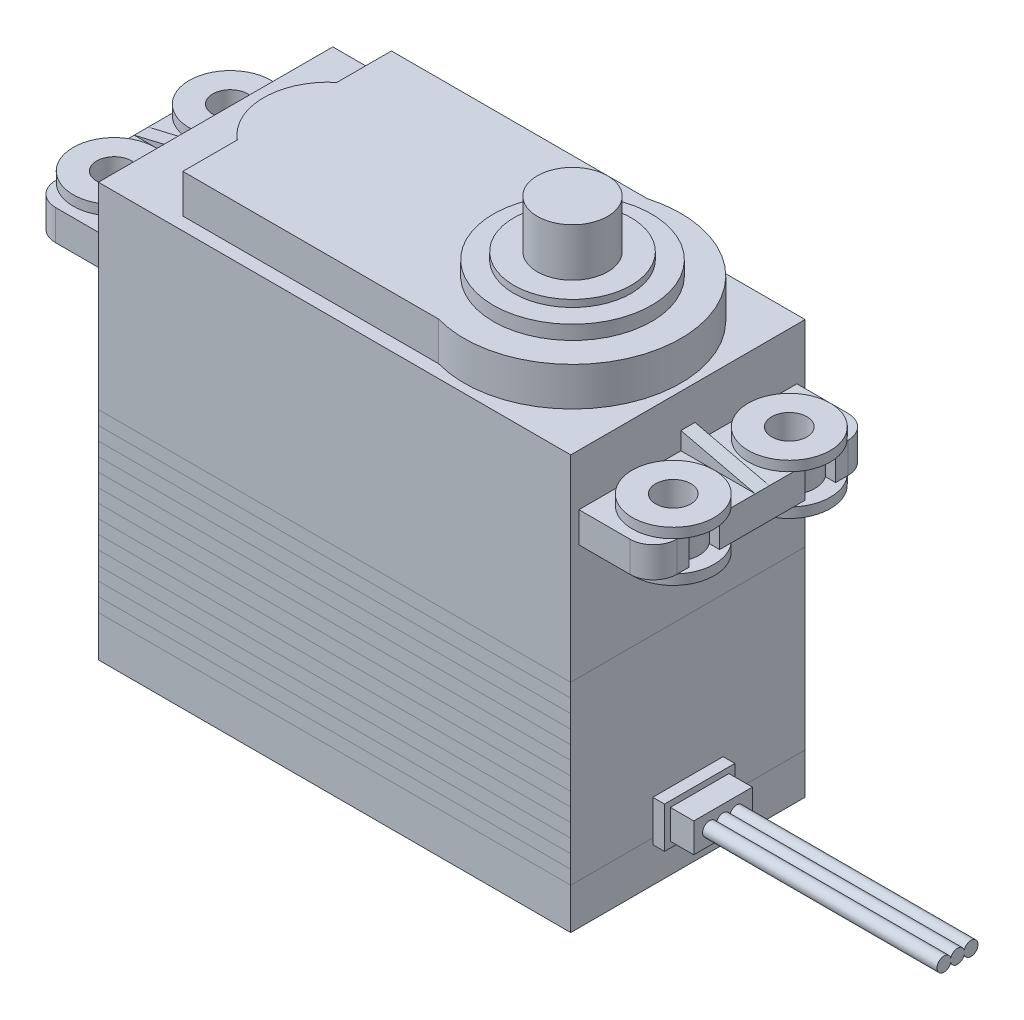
from build123d import *

# Parameters (mm, degrees)
ESQUISSE1_W                              = 40.3
ESQUISSE1_H                              = 20
BOSS_EXTRU_1_DEPTH                       = 35.3
BOSS_EXTRU_2_DEPTH                       = 2.6
BOSS_EXTRU_3_DEPTH                       = 0.6
CONG_1_R                                 = 2
BOSS_EXTRU_4_DEPTH                       = 3.3
ESQUISSE5_R                              = 6.75
BOSS_EXTRU_5_DEPTH                       = 1.2
ESQUISSE6_R                              = 5
BOSS_EXTRU_6_DEPTH                       = 0.6
ESQUISSE7_R                              = 3
BOSS_EXTRU_7_DEPTH                       = 4.1
ESQUISSE10_W                             = 2.2
ESQUISSE10_H                             = 30.9
DIAM_TRE_DU_PER_AGE_4_4_4_4_1_AT_2_COUNT = 2
DIAM_TRE_DU_PER_AGE_4_4_4_4_1_AT_2_PITCH = 9.9
DIAM_TRE_DU_PER_AGE_4_4_4_4_1_AT_3_COUNT = 2
DIAM_TRE_DU_PER_AGE_4_4_4_4_1_AT_3_PITCH = 48.71652697
DIAM_TRE_DU_PER_AGE_4_4_4_4_1_AT_4_COUNT = 2
DIAM_TRE_DU_PER_AGE_4_4_4_4_1_AT_4_PITCH = 47.7
R_P_TITION_LIN_AIRE1_COUNT               = 2
R_P_TITION_LIN_AIRE1_PITCH               = 47.7
R_P_TITION_LIN_AIRE1_COUNT_DIR2          = 2
R_P_TITION_LIN_AIRE1_PITCH_DIR2          = 9.9
ESQUISSE13_W                             = 6
ESQUISSE13_H                             = 3.5
BOSS_EXTRU_8_DEPTH                       = 1
ESQUISSE14_W                             = 5
ESQUISSE14_H                             = 2.5
BOSS_EXTRU_9_DEPTH                       = 2
BOSS_EXTRU_10_DEPTH                      = 20


with BuildPart() as part:
    # Esquisse1 → Boss.-Extru.1 (new body)
    with BuildSketch(Plane(origin=(0, 0, 0), x_dir=(1, 0, 0), z_dir=(0, 1, 0))):
        Rectangle(ESQUISSE1_W, ESQUISSE1_H)
    extrude(amount=BOSS_EXTRU_1_DEPTH)

    # Esquisse2 → Boss.-Extru.2 (add)
    with BuildSketch(Plane(origin=(0, 28.3, 0), x_dir=(-1, 0, 0), z_dir=(0, -1, 0))):
        with BuildLine():
            Line((-26.5, 9.3), (-20.15, 9.3))
            Line((-20.15, 9.3), (-20.15, -9.3))
            Line((-20.15, -9.3), (-26.5, -9.3))
            Line((-26.5, -9.3), (-26.5, -6.25))
            Line((-26.5, -6.25), (-25.562454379, -6.25))
            ThreePointArc((-25.562454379, -6.25), (-21.7, -4.95), (-25.562454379, -3.65))
            Line((-25.562454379, -3.65), (-26.5, -3.65))
            Line((-26.5, -3.65), (-26.5, 3.65))
            Line((-26.5, 3.65), (-25.562454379, 3.65))
            ThreePointArc((-25.562454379, 3.65), (-21.7, 4.95), (-25.562454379, 6.25))
            Line((-25.562454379, 6.25), (-26.5, 6.25))
            Line((-26.5, 6.25), (-26.5, 9.3))
        make_face()
        with BuildLine():
            Line((26.5, 9.3), (20.15, 9.3))
            Line((20.15, 9.3), (20.15, -9.3))
            Line((20.15, -9.3), (26.5, -9.3))
            Line((26.5, -9.3), (26.5, -6.25))
            Line((26.5, -6.25), (25.562454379, -6.25))
            ThreePointArc((25.562454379, -6.25), (21.7, -4.95), (25.562454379, -3.65))
            Line((25.562454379, -3.65), (26.5, -3.65))
            Line((26.5, -3.65), (26.5, 3.65))
            Line((26.5, 3.65), (25.562454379, 3.65))
            ThreePointArc((25.562454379, 3.65), (21.7, 4.95), (25.562454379, 6.25))
            Line((25.562454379, 6.25), (26.5, 6.25))
            Line((26.5, 6.25), (26.5, 9.3))
        make_face()
    extrude(amount=-BOSS_EXTRU_2_DEPTH)

    # Esquisse3 → Boss.-Extru.3 (add, symmetric)
    with BuildSketch(Plane.XY):
        Polygon((-26.5, 30.9), (-20.15, 30.9), (-20.15, 32.4), align=None)
        Polygon((26.5, 30.9), (20.15, 30.9), (20.15, 32.4), align=None)
    extrude(amount=BOSS_EXTRU_3_DEPTH, both=True)

    # Cong_1
    cong_1_edges = [part.edges().sort_by_distance(p)[0] for p in [
        (26.5, 29.6, -9.3),
        (26.5, 29.6, 9.3),
        (-26.5, 29.6, -9.3),
        (-26.5, 29.6, 9.3),
    ]]
    fillet(cong_1_edges, radius=CONG_1_R)

    # Esquisse4 → Boss.-Extru.4 (add)
    with BuildSketch(Plane(origin=(0, 35.3, 0), x_dir=(1, 0, 0), z_dir=(0, 1, 0))):
        with BuildLine():
            Line((-14.05, 8.9), (7.779583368, 8.9))
            ThreePointArc((7.779583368, 8.9), (19.55, 0), (7.779583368, -8.9))
            Line((7.779583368, -8.9), (-14.05, -8.9))
            Line((-14.05, -8.9), (-14.05, -4.25))
            ThreePointArc((-14.05, -4.25), (-16.05, 0), (-14.05, 4.25))
            Line((-14.05, 4.25), (-14.05, 8.9))
        make_face()
    extrude(amount=BOSS_EXTRU_4_DEPTH)

    # Esquisse5 → Boss.-Extru.5 (add)
    with BuildSketch(Plane(origin=(0, 38.6, 0), x_dir=(1, 0, 0), z_dir=(0, 1, 0))):
        with Locations(Location((10.3, 0, 0), (0, 0, 270))):
            Circle(ESQUISSE5_R)
    extrude(amount=BOSS_EXTRU_5_DEPTH)

    # Esquisse6 → Boss.-Extru.6 (add)
    with BuildSketch(Plane(origin=(0, 39.8, 0), x_dir=(1, 0, 0), z_dir=(0, 1, 0))):
        with Locations(Location((10.3, 0, 0), (0, 0, 270))):
            Circle(ESQUISSE6_R)
    extrude(amount=BOSS_EXTRU_6_DEPTH)

    # Esquisse10 → Diam_tre du per_age _4.4 _4.4_1 (revolve, cut)
    with BuildSketch(Plane(origin=(-23.85, 30.9, -4.95), x_dir=(0, 0, 1), z_dir=(1, 0, 0))):
        with Locations((1.1, 15.45)):
            Rectangle(ESQUISSE10_W, ESQUISSE10_H)
    diam_tre_du_per_age_4_4_4_4_1 = revolve(axis=Axis((-23.85, 37.25, -4.95), (0, -1, 0)), mode=Mode.SUBTRACT)

    # Diam_tre du per_age _4.4 _4.4_1 at 2: Diam_tre du per_age _4.4 _4.4_1 ×2
    with Locations(*[(0, 0, i * DIAM_TRE_DU_PER_AGE_4_4_4_4_1_AT_2_PITCH) for i in range(1, DIAM_TRE_DU_PER_AGE_4_4_4_4_1_AT_2_COUNT)]):
        add(diam_tre_du_per_age_4_4_4_4_1, mode=Mode.SUBTRACT)

    # Diam_tre du per_age _4.4 _4.4_1 at 3: Diam_tre du per_age _4.4 _4.4_1 ×2
    with Locations(*[Vector(0.9791338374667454, 0, 0.20321645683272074) * (i * DIAM_TRE_DU_PER_AGE_4_4_4_4_1_AT_3_PITCH) for i in range(1, DIAM_TRE_DU_PER_AGE_4_4_4_4_1_AT_3_COUNT)]):
        add(diam_tre_du_per_age_4_4_4_4_1, mode=Mode.SUBTRACT)

    # Diam_tre du per_age _4.4 _4.4_1 at 4: Diam_tre du per_age _4.4 _4.4_1 ×2
    with Locations(*[(i * DIAM_TRE_DU_PER_AGE_4_4_4_4_1_AT_4_PITCH, 0, 0) for i in range(1, DIAM_TRE_DU_PER_AGE_4_4_4_4_1_AT_4_COUNT)]):
        add(diam_tre_du_per_age_4_4_4_4_1, mode=Mode.SUBTRACT)

    # Esquisse12 → R_volution1 (revolve)
    with BuildSketch(Plane(origin=(-23.85, 0, 0), x_dir=(0, 0, -1), z_dir=(1, 0, 0)), mode=Mode.PRIVATE) as r_volution1_sk:
        Polygon((-8.45, 30.9), (-8.45, 31.75), (-6.45, 31.75), (-6.45, 27.45), (-8.45, 27.45), (-8.45, 28.3), (-7.15, 28.3), (-7.15, 30.9), align=None)
    r_volution1 = revolve(r_volution1_sk.sketch.rotate(Axis((-23.85, 28.3, 4.95), (0, 1, 0)), 180), axis=Axis((-23.85, 28.3, 4.95), (0, 1, 0)))

    # R_p_tition lin_aire1: R_volution1 2 × 2
    with Locations(*[(i * R_P_TITION_LIN_AIRE1_PITCH, 0, -j * R_P_TITION_LIN_AIRE1_PITCH_DIR2) for i in range(R_P_TITION_LIN_AIRE1_COUNT) for j in range(R_P_TITION_LIN_AIRE1_COUNT_DIR2) if (i, j) != (0, 0)]):
        add(r_volution1)



with BuildPart() as body_2:
    # Esquisse7 → Boss.-Extru.7 (new body)
    with BuildSketch(Plane(origin=(0, 40.4, 0), x_dir=(1, 0, 0), z_dir=(0, 1, 0))):
        with Locations(Location((10.3, 0, 0), (0, 0, 270))):
            Circle(ESQUISSE7_R)
    extrude(amount=BOSS_EXTRU_7_DEPTH)


with BuildPart() as body_3:
    # Esquisse13 → Boss.-Extru.8 (new body)
    with BuildSketch(Plane(origin=(20.15, 0, 0), x_dir=(0, 0, -1), z_dir=(1, 0, 0))):
        with Locations((0, 4.75)):
            Rectangle(ESQUISSE13_W, ESQUISSE13_H)
    extrude(amount=BOSS_EXTRU_8_DEPTH)


with BuildPart() as part_1:
    add(part.part)

    add(body_3.part)  # Boss.-Extru.9 merges body 3
    # Esquisse14 → Boss.-Extru.9 (add)
    with BuildSketch(Plane(origin=(21.15, 0, 0), x_dir=(0, 0, -1), z_dir=(1, 0, 0))):
        with Locations((0, 4.75)):
            Rectangle(ESQUISSE14_W, ESQUISSE14_H)
    extrude(amount=BOSS_EXTRU_9_DEPTH)


with BuildPart() as body_3_2:
    # Esquisse15 → Boss.-Extru.10 (new body)
    with BuildSketch(Plane(origin=(23.15, 0, 0), x_dir=(0, 0, -1), z_dir=(1, 0, 0))):
        with BuildLine():
            ThreePointArc((0.575, 4.921391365), (0, 5.35), (-0.575, 4.921391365))
            ThreePointArc((-0.575, 4.921391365), (-1.75, 4.75), (-0.575, 4.578608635))
            ThreePointArc((-0.575, 4.578608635), (0, 4.15), (0.575, 4.578608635))
            ThreePointArc((0.575, 4.578608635), (1.75, 4.75), (0.575, 4.921391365))
        make_face()
    extrude(amount=BOSS_EXTRU_10_DEPTH)


solid = Compound([body_2.part, part_1.part, body_3_2.part])
